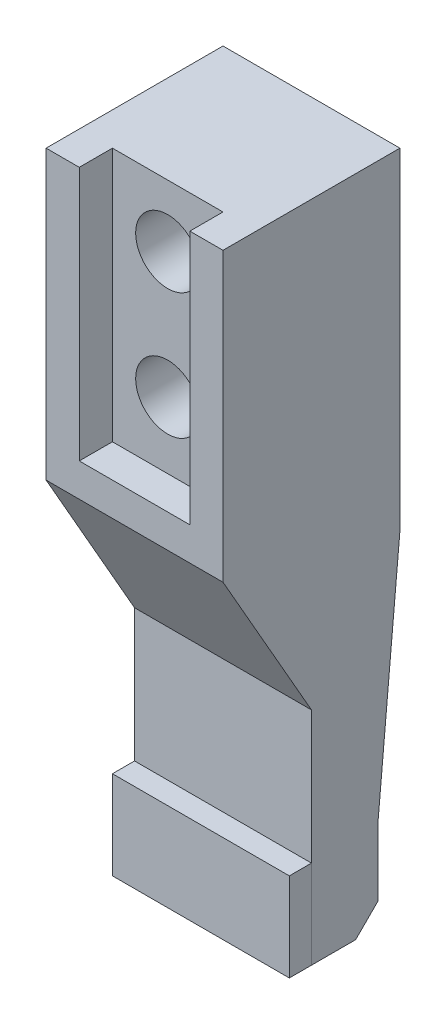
ISO-10303-21;
HEADER;
FILE_DESCRIPTION(('STEP AP214'),'2;1');
FILE_NAME('part.step','',(''),(''),'','','');
FILE_SCHEMA(('AUTOMOTIVE_DESIGN { 1 0 10303 214 1 1 1 1 }'));
ENDSEC;
DATA;
#1=APPLICATION_CONTEXT('core data for automotive mechanical design processes');
#2=APPLICATION_PROTOCOL_DEFINITION('international standard','automotive_design',2000,#1);
#3=PRODUCT_CONTEXT('',#1,'mechanical');
#4=PRODUCT('Part','Part','',(#3));
#5=PRODUCT_RELATED_PRODUCT_CATEGORY('part','',(#4));
#6=PRODUCT_DEFINITION_FORMATION('','',#4);
#7=PRODUCT_DEFINITION_CONTEXT('part definition',#1,'design');
#8=PRODUCT_DEFINITION('design','',#6,#7);
#9=PRODUCT_DEFINITION_SHAPE('','',#8);
#10=(LENGTH_UNIT() NAMED_UNIT(*) SI_UNIT(.MILLI.,.METRE.));
#11=(NAMED_UNIT(*) PLANE_ANGLE_UNIT() SI_UNIT($,.RADIAN.));
#12=(NAMED_UNIT(*) SI_UNIT($,.STERADIAN.) SOLID_ANGLE_UNIT());
#13=UNCERTAINTY_MEASURE_WITH_UNIT(LENGTH_MEASURE(1.E-05),#10,'distance_accuracy_value','');
#14=(GEOMETRIC_REPRESENTATION_CONTEXT(3) GLOBAL_UNCERTAINTY_ASSIGNED_CONTEXT((#13)) GLOBAL_UNIT_ASSIGNED_CONTEXT((#10,
#11,#12)) REPRESENTATION_CONTEXT('',''));
#15=CARTESIAN_POINT('',(0.,0.,0.));
#16=DIRECTION('',(0.,0.,1.));
#17=DIRECTION('',(1.,0.,0.));
#18=AXIS2_PLACEMENT_3D('',#15,#16,#17);
#19=CARTESIAN_POINT('',(-4.,-15.,5.));
#20=DIRECTION('',(1.,0.,0.));
#21=DIRECTION('',(0.,0.,-1.));
#22=AXIS2_PLACEMENT_3D('',#19,#20,#21);
#23=PLANE('',#22);
#24=DIRECTION('',(0.,-1.,0.));
#25=VECTOR('',#24,1.);
#26=CARTESIAN_POINT('',(-4.,-15.,4.));
#27=LINE('',#26,#25);
#28=CARTESIAN_POINT('',(-4.,-11.,4.));
#29=VERTEX_POINT('',#28);
#30=CARTESIAN_POINT('',(-4.,-15.,4.));
#31=VERTEX_POINT('',#30);
#32=EDGE_CURVE('E110',#29,#31,#27,.T.);
#33=ORIENTED_EDGE('',*,*,#32,.T.);
#34=DIRECTION('',(0.,0.,-1.));
#35=VECTOR('',#34,1.);
#36=CARTESIAN_POINT('',(-4.,-15.,5.));
#37=LINE('',#36,#35);
#38=CARTESIAN_POINT('',(-4.,-15.,5.));
#39=VERTEX_POINT('',#38);
#40=EDGE_CURVE('E12',#39,#31,#37,.T.);
#41=ORIENTED_EDGE('',*,*,#40,.F.);
#42=DIRECTION('',(0.,-1.,0.));
#43=VECTOR('',#42,1.);
#44=CARTESIAN_POINT('',(-4.,-15.,5.));
#45=LINE('',#44,#43);
#46=CARTESIAN_POINT('',(-4.,-11.,5.));
#47=VERTEX_POINT('',#46);
#48=EDGE_CURVE('E98',#47,#39,#45,.T.);
#49=ORIENTED_EDGE('',*,*,#48,.F.);
#50=DIRECTION('',(0.,0.,-1.));
#51=VECTOR('',#50,1.);
#52=CARTESIAN_POINT('',(-4.,-11.,5.));
#53=LINE('',#52,#51);
#54=EDGE_CURVE('E106',#47,#29,#53,.T.);
#55=ORIENTED_EDGE('',*,*,#54,.T.);
#56=EDGE_LOOP('',(#33,#41,#49,#55));
#57=FACE_BOUND('',#56,.T.);
#58=ADVANCED_FACE('F47',(#57),#23,.F.);
#59=CARTESIAN_POINT('',(-4.,-15.,5.));
#60=DIRECTION('',(0.,1.,0.));
#61=DIRECTION('',(0.,0.,1.));
#62=AXIS2_PLACEMENT_3D('',#59,#60,#61);
#63=PLANE('',#62);
#64=DIRECTION('',(1.,0.,0.));
#65=VECTOR('',#64,1.);
#66=CARTESIAN_POINT('',(-4.,-15.,4.));
#67=LINE('',#66,#65);
#68=CARTESIAN_POINT('',(4.,-15.,4.));
#69=VERTEX_POINT('',#68);
#70=EDGE_CURVE('E102',#31,#69,#67,.T.);
#71=ORIENTED_EDGE('',*,*,#70,.T.);
#72=DIRECTION('',(0.,0.,-1.));
#73=VECTOR('',#72,1.);
#74=CARTESIAN_POINT('',(4.,-15.,5.));
#75=LINE('',#74,#73);
#76=CARTESIAN_POINT('',(4.,-15.,5.));
#77=VERTEX_POINT('',#76);
#78=EDGE_CURVE('E55',#77,#69,#75,.T.);
#79=ORIENTED_EDGE('',*,*,#78,.F.);
#80=DIRECTION('',(1.,0.,0.));
#81=VECTOR('',#80,1.);
#82=CARTESIAN_POINT('',(-4.,-15.,5.));
#83=LINE('',#82,#81);
#84=EDGE_CURVE('E93',#39,#77,#83,.T.);
#85=ORIENTED_EDGE('',*,*,#84,.F.);
#86=ORIENTED_EDGE('',*,*,#40,.T.);
#87=EDGE_LOOP('',(#71,#79,#85,#86));
#88=FACE_BOUND('',#87,.T.);
#89=ADVANCED_FACE('F101',(#88),#63,.F.);
#90=CARTESIAN_POINT('',(4.,-15.,5.));
#91=DIRECTION('',(-1.,0.,0.));
#92=DIRECTION('',(0.,0.,1.));
#93=AXIS2_PLACEMENT_3D('',#90,#91,#92);
#94=PLANE('',#93);
#95=DIRECTION('',(0.,1.,0.));
#96=VECTOR('',#95,1.);
#97=CARTESIAN_POINT('',(4.,-15.,4.));
#98=LINE('',#97,#96);
#99=CARTESIAN_POINT('',(4.,-11.,4.));
#100=VERTEX_POINT('',#99);
#101=EDGE_CURVE('E80',#69,#100,#98,.T.);
#102=ORIENTED_EDGE('',*,*,#101,.T.);
#103=DIRECTION('',(0.,0.,-1.));
#104=VECTOR('',#103,1.);
#105=CARTESIAN_POINT('',(4.,-11.,5.));
#106=LINE('',#105,#104);
#107=CARTESIAN_POINT('',(4.,-11.,5.));
#108=VERTEX_POINT('',#107);
#109=EDGE_CURVE('E103',#108,#100,#106,.T.);
#110=ORIENTED_EDGE('',*,*,#109,.F.);
#111=DIRECTION('',(0.,1.,0.));
#112=VECTOR('',#111,1.);
#113=CARTESIAN_POINT('',(4.,-15.,5.));
#114=LINE('',#113,#112);
#115=EDGE_CURVE('E96',#77,#108,#114,.T.);
#116=ORIENTED_EDGE('',*,*,#115,.F.);
#117=ORIENTED_EDGE('',*,*,#78,.T.);
#118=EDGE_LOOP('',(#102,#110,#116,#117));
#119=FACE_BOUND('',#118,.T.);
#120=ADVANCED_FACE('F104',(#119),#94,.F.);
#121=CARTESIAN_POINT('',(-4.,-11.,5.));
#122=DIRECTION('',(0.,-1.,0.));
#123=DIRECTION('',(0.,0.,-1.));
#124=AXIS2_PLACEMENT_3D('',#121,#122,#123);
#125=PLANE('',#124);
#126=DIRECTION('',(-1.,0.,0.));
#127=VECTOR('',#126,1.);
#128=CARTESIAN_POINT('',(-4.,-11.,4.));
#129=LINE('',#128,#127);
#130=EDGE_CURVE('E86',#100,#29,#129,.T.);
#131=ORIENTED_EDGE('',*,*,#130,.T.);
#132=ORIENTED_EDGE('',*,*,#54,.F.);
#133=DIRECTION('',(-1.,0.,0.));
#134=VECTOR('',#133,1.);
#135=CARTESIAN_POINT('',(-4.,-11.,5.));
#136=LINE('',#135,#134);
#137=EDGE_CURVE('E63',#108,#47,#136,.T.);
#138=ORIENTED_EDGE('',*,*,#137,.F.);
#139=ORIENTED_EDGE('',*,*,#109,.T.);
#140=EDGE_LOOP('',(#131,#132,#138,#139));
#141=FACE_BOUND('',#140,.T.);
#142=ADVANCED_FACE('F117',(#141),#125,.F.);
#143=CARTESIAN_POINT('',(0.,0.,5.));
#144=DIRECTION('',(0.,0.,-1.));
#145=DIRECTION('',(-1.,0.,0.));
#146=AXIS2_PLACEMENT_3D('',#143,#144,#145);
#147=PLANE('',#146);
#148=ORIENTED_EDGE('',*,*,#48,.T.);
#149=ORIENTED_EDGE('',*,*,#84,.T.);
#150=ORIENTED_EDGE('',*,*,#115,.T.);
#151=ORIENTED_EDGE('',*,*,#137,.T.);
#152=EDGE_LOOP('',(#148,#149,#150,#151));
#153=FACE_BOUND('',#152,.T.);
#154=ADVANCED_FACE('F94',(#153),#147,.F.);
#155=CARTESIAN_POINT('',(0.,0.,4.));
#156=DIRECTION('',(0.,0.,-1.));
#157=DIRECTION('',(-1.,0.,0.));
#158=AXIS2_PLACEMENT_3D('',#155,#156,#157);
#159=PLANE('',#158);
#160=ORIENTED_EDGE('',*,*,#32,.F.);
#161=ORIENTED_EDGE('',*,*,#130,.F.);
#162=ORIENTED_EDGE('',*,*,#101,.F.);
#163=ORIENTED_EDGE('',*,*,#70,.F.);
#164=EDGE_LOOP('',(#160,#161,#162,#163));
#165=FACE_BOUND('',#164,.T.);
#166=ADVANCED_FACE('F120',(#165),#159,.T.);
#167=CLOSED_SHELL('',(#58,#89,#120,#142,#154,#166));
#168=MANIFOLD_SOLID_BREP('B2',#167);
#169=CARTESIAN_POINT('',(4.,-15.,8.));
#170=DIRECTION('',(-1.,0.,0.));
#171=DIRECTION('',(0.,0.,1.));
#172=AXIS2_PLACEMENT_3D('',#169,#170,#171);
#173=PLANE('',#172);
#174=DIRECTION('',(0.,0.,-1.));
#175=VECTOR('',#174,1.);
#176=CARTESIAN_POINT('',(4.,-15.,8.));
#177=LINE('',#176,#175);
#178=CARTESIAN_POINT('',(4.,-15.,4.));
#179=VERTEX_POINT('',#178);
#180=CARTESIAN_POINT('',(4.,-15.,2.));
#181=VERTEX_POINT('',#180);
#182=EDGE_CURVE('E354',#179,#181,#177,.T.);
#183=ORIENTED_EDGE('',*,*,#182,.T.);
#184=DIRECTION('',(0.,-0.707106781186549,0.707106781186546));
#185=VECTOR('',#184,1.);
#186=CARTESIAN_POINT('',(4.,-15.,2.));
#187=LINE('',#186,#185);
#188=CARTESIAN_POINT('',(4.,-14.,1.));
#189=VERTEX_POINT('',#188);
#190=EDGE_CURVE('E194',#181,#189,#187,.F.);
#191=ORIENTED_EDGE('',*,*,#190,.T.);
#192=DIRECTION('',(0.,-1.,0.));
#193=VECTOR('',#192,1.);
#194=CARTESIAN_POINT('',(4.,-15.,1.));
#195=LINE('',#194,#193);
#196=CARTESIAN_POINT('',(4.,-11.,1.));
#197=VERTEX_POINT('',#196);
#198=EDGE_CURVE('E286',#197,#189,#195,.T.);
#199=ORIENTED_EDGE('',*,*,#198,.F.);
#200=DIRECTION('',(0.,-0.995893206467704,0.0905357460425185));
#201=VECTOR('',#200,1.);
#202=CARTESIAN_POINT('',(4.,-11.,1.));
#203=LINE('',#202,#201);
#204=CARTESIAN_POINT('',(4.,0.,0.));
#205=VERTEX_POINT('',#204);
#206=EDGE_CURVE('E272',#205,#197,#203,.T.);
#207=ORIENTED_EDGE('',*,*,#206,.F.);
#208=DIRECTION('',(0.,1.,0.));
#209=VECTOR('',#208,1.);
#210=CARTESIAN_POINT('',(4.,-15.,0.));
#211=LINE('',#210,#209);
#212=CARTESIAN_POINT('',(4.,15.,0.));
#213=VERTEX_POINT('',#212);
#214=EDGE_CURVE('E337',#205,#213,#211,.T.);
#215=ORIENTED_EDGE('',*,*,#214,.T.);
#216=DIRECTION('',(0.,0.,-1.));
#217=VECTOR('',#216,1.);
#218=CARTESIAN_POINT('',(4.,15.,8.));
#219=LINE('',#218,#217);
#220=CARTESIAN_POINT('',(4.,15.,8.));
#221=VERTEX_POINT('',#220);
#222=EDGE_CURVE('E365',#221,#213,#219,.T.);
#223=ORIENTED_EDGE('',*,*,#222,.F.);
#224=DIRECTION('',(0.,1.,0.));
#225=VECTOR('',#224,1.);
#226=CARTESIAN_POINT('',(4.,-15.,8.));
#227=LINE('',#226,#225);
#228=CARTESIAN_POINT('',(4.,2.,8.));
#229=VERTEX_POINT('',#228);
#230=EDGE_CURVE('E345',#229,#221,#227,.T.);
#231=ORIENTED_EDGE('',*,*,#230,.F.);
#232=DIRECTION('',(0.,0.868243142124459,0.496138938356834));
#233=VECTOR('',#232,1.);
#234=CARTESIAN_POINT('',(4.,-10.8153846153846,0.676923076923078));
#235=LINE('',#234,#233);
#236=CARTESIAN_POINT('',(4.,-5.,4.));
#237=VERTEX_POINT('',#236);
#238=EDGE_CURVE('E307',#237,#229,#235,.T.);
#239=ORIENTED_EDGE('',*,*,#238,.F.);
#240=DIRECTION('',(0.,1.,0.));
#241=VECTOR('',#240,1.);
#242=CARTESIAN_POINT('',(4.,-15.,4.));
#243=LINE('',#242,#241);
#244=EDGE_CURVE('E313',#179,#237,#243,.T.);
#245=ORIENTED_EDGE('',*,*,#244,.F.);
#246=EDGE_LOOP('',(#183,#191,#199,#207,#215,#223,#231,#239,#245));
#247=FACE_BOUND('',#246,.T.);
#248=ADVANCED_FACE('F171',(#247),#173,.F.);
#249=CARTESIAN_POINT('',(-4.,-15.,8.));
#250=DIRECTION('',(1.,0.,0.));
#251=DIRECTION('',(0.,0.,-1.));
#252=AXIS2_PLACEMENT_3D('',#249,#250,#251);
#253=PLANE('',#252);
#254=DIRECTION('',(0.,-1.,0.));
#255=VECTOR('',#254,1.);
#256=CARTESIAN_POINT('',(-4.,-15.,1.));
#257=LINE('',#256,#255);
#258=CARTESIAN_POINT('',(-4.,-11.,1.));
#259=VERTEX_POINT('',#258);
#260=CARTESIAN_POINT('',(-4.,-14.,1.));
#261=VERTEX_POINT('',#260);
#262=EDGE_CURVE('E276',#259,#261,#257,.T.);
#263=ORIENTED_EDGE('',*,*,#262,.T.);
#264=DIRECTION('',(0.,0.707106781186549,-0.707106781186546));
#265=VECTOR('',#264,1.);
#266=CARTESIAN_POINT('',(-4.,-15.,2.));
#267=LINE('',#266,#265);
#268=CARTESIAN_POINT('',(-4.,-15.,2.));
#269=VERTEX_POINT('',#268);
#270=EDGE_CURVE('E45',#261,#269,#267,.F.);
#271=ORIENTED_EDGE('',*,*,#270,.T.);
#272=DIRECTION('',(0.,0.,-1.));
#273=VECTOR('',#272,1.);
#274=CARTESIAN_POINT('',(-4.,-15.,8.));
#275=LINE('',#274,#273);
#276=CARTESIAN_POINT('',(-4.,-15.,4.));
#277=VERTEX_POINT('',#276);
#278=EDGE_CURVE('E360',#277,#269,#275,.T.);
#279=ORIENTED_EDGE('',*,*,#278,.F.);
#280=DIRECTION('',(0.,-1.,0.));
#281=VECTOR('',#280,1.);
#282=CARTESIAN_POINT('',(-4.,0.,4.));
#283=LINE('',#282,#281);
#284=CARTESIAN_POINT('',(-4.,-5.,4.));
#285=VERTEX_POINT('',#284);
#286=EDGE_CURVE('E299',#285,#277,#283,.T.);
#287=ORIENTED_EDGE('',*,*,#286,.F.);
#288=DIRECTION('',(0.,-0.868243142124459,-0.496138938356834));
#289=VECTOR('',#288,1.);
#290=CARTESIAN_POINT('',(-4.,-2.95384615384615,5.16923076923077));
#291=LINE('',#290,#289);
#292=CARTESIAN_POINT('',(-4.,2.00000000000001,8.));
#293=VERTEX_POINT('',#292);
#294=EDGE_CURVE('E301',#293,#285,#291,.T.);
#295=ORIENTED_EDGE('',*,*,#294,.F.);
#296=DIRECTION('',(0.,-1.,0.));
#297=VECTOR('',#296,1.);
#298=CARTESIAN_POINT('',(-4.,-15.,8.));
#299=LINE('',#298,#297);
#300=CARTESIAN_POINT('',(-4.,15.,8.));
#301=VERTEX_POINT('',#300);
#302=EDGE_CURVE('E351',#301,#293,#299,.T.);
#303=ORIENTED_EDGE('',*,*,#302,.F.);
#304=DIRECTION('',(0.,0.,-1.));
#305=VECTOR('',#304,1.);
#306=CARTESIAN_POINT('',(-4.,15.,8.));
#307=LINE('',#306,#305);
#308=CARTESIAN_POINT('',(-4.,15.,0.));
#309=VERTEX_POINT('',#308);
#310=EDGE_CURVE('E363',#301,#309,#307,.T.);
#311=ORIENTED_EDGE('',*,*,#310,.T.);
#312=DIRECTION('',(0.,-1.,0.));
#313=VECTOR('',#312,1.);
#314=CARTESIAN_POINT('',(-4.,-15.,0.));
#315=LINE('',#314,#313);
#316=CARTESIAN_POINT('',(-4.,0.,0.));
#317=VERTEX_POINT('',#316);
#318=EDGE_CURVE('E285',#309,#317,#315,.T.);
#319=ORIENTED_EDGE('',*,*,#318,.T.);
#320=DIRECTION('',(0.,-0.995893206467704,0.0905357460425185));
#321=VECTOR('',#320,1.);
#322=CARTESIAN_POINT('',(-4.,-11.,1.));
#323=LINE('',#322,#321);
#324=EDGE_CURVE('E269',#317,#259,#323,.T.);
#325=ORIENTED_EDGE('',*,*,#324,.T.);
#326=EDGE_LOOP('',(#263,#271,#279,#287,#295,#303,#311,#319,#325));
#327=FACE_BOUND('',#326,.T.);
#328=ADVANCED_FACE('F282',(#327),#253,.F.);
#329=CARTESIAN_POINT('',(-4.,-15.,8.));
#330=DIRECTION('',(0.,1.,0.));
#331=DIRECTION('',(0.,0.,1.));
#332=AXIS2_PLACEMENT_3D('',#329,#330,#331);
#333=PLANE('',#332);
#334=ORIENTED_EDGE('',*,*,#278,.T.);
#335=DIRECTION('',(1.,0.,0.));
#336=VECTOR('',#335,1.);
#337=CARTESIAN_POINT('',(-4.,-15.,2.));
#338=LINE('',#337,#336);
#339=EDGE_CURVE('E368',#269,#181,#338,.T.);
#340=ORIENTED_EDGE('',*,*,#339,.T.);
#341=ORIENTED_EDGE('',*,*,#182,.F.);
#342=DIRECTION('',(1.,0.,0.));
#343=VECTOR('',#342,1.);
#344=CARTESIAN_POINT('',(-4.,-15.,4.));
#345=LINE('',#344,#343);
#346=EDGE_CURVE('E303',#277,#179,#345,.T.);
#347=ORIENTED_EDGE('',*,*,#346,.F.);
#348=EDGE_LOOP('',(#334,#340,#341,#347));
#349=FACE_BOUND('',#348,.T.);
#350=ADVANCED_FACE('F378',(#349),#333,.F.);
#351=CARTESIAN_POINT('',(0.,0.,8.));
#352=DIRECTION('',(0.,0.,-1.));
#353=DIRECTION('',(-1.,0.,0.));
#354=AXIS2_PLACEMENT_3D('',#351,#352,#353);
#355=PLANE('',#354);
#356=DIRECTION('',(1.,0.,0.));
#357=VECTOR('',#356,1.);
#358=CARTESIAN_POINT('',(-4.,2.00000000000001,8.));
#359=LINE('',#358,#357);
#360=EDGE_CURVE('E304',#293,#229,#359,.T.);
#361=ORIENTED_EDGE('',*,*,#360,.T.);
#362=ORIENTED_EDGE('',*,*,#230,.T.);
#363=DIRECTION('',(-1.,0.,0.));
#364=VECTOR('',#363,1.);
#365=CARTESIAN_POINT('',(-4.,15.,8.));
#366=LINE('',#365,#364);
#367=CARTESIAN_POINT('',(2.5,15.,8.));
#368=VERTEX_POINT('',#367);
#369=EDGE_CURVE('E348',#221,#368,#366,.T.);
#370=ORIENTED_EDGE('',*,*,#369,.T.);
#371=DIRECTION('',(0.,1.,0.));
#372=VECTOR('',#371,1.);
#373=CARTESIAN_POINT('',(2.5,15.,8.));
#374=LINE('',#373,#372);
#375=CARTESIAN_POINT('',(2.5,3.5,8.));
#376=VERTEX_POINT('',#375);
#377=EDGE_CURVE('E320',#376,#368,#374,.T.);
#378=ORIENTED_EDGE('',*,*,#377,.F.);
#379=DIRECTION('',(1.,0.,0.));
#380=VECTOR('',#379,1.);
#381=CARTESIAN_POINT('',(-2.5,3.5,8.));
#382=LINE('',#381,#380);
#383=CARTESIAN_POINT('',(-2.5,3.5,8.));
#384=VERTEX_POINT('',#383);
#385=EDGE_CURVE('E331',#384,#376,#382,.T.);
#386=ORIENTED_EDGE('',*,*,#385,.F.);
#387=DIRECTION('',(0.,-1.,0.));
#388=VECTOR('',#387,1.);
#389=CARTESIAN_POINT('',(-2.5,15.,8.));
#390=LINE('',#389,#388);
#391=CARTESIAN_POINT('',(-2.5,15.,8.));
#392=VERTEX_POINT('',#391);
#393=EDGE_CURVE('E315',#392,#384,#390,.T.);
#394=ORIENTED_EDGE('',*,*,#393,.F.);
#395=EDGE_CURVE('E347',#392,#301,#366,.T.);
#396=ORIENTED_EDGE('',*,*,#395,.T.);
#397=ORIENTED_EDGE('',*,*,#302,.T.);
#398=EDGE_LOOP('',(#361,#362,#370,#378,#386,#394,#396,#397));
#399=FACE_BOUND('',#398,.T.);
#400=ADVANCED_FACE('F394',(#399),#355,.F.);
#401=CARTESIAN_POINT('',(-4.,15.,8.));
#402=DIRECTION('',(0.,-1.,0.));
#403=DIRECTION('',(0.,0.,-1.));
#404=AXIS2_PLACEMENT_3D('',#401,#402,#403);
#405=PLANE('',#404);
#406=ORIENTED_EDGE('',*,*,#395,.F.);
#407=DIRECTION('',(0.,0.,1.));
#408=VECTOR('',#407,1.);
#409=CARTESIAN_POINT('',(-2.5,15.,6.5));
#410=LINE('',#409,#408);
#411=CARTESIAN_POINT('',(-2.5,15.,6.5));
#412=VERTEX_POINT('',#411);
#413=EDGE_CURVE('E335',#412,#392,#410,.T.);
#414=ORIENTED_EDGE('',*,*,#413,.F.);
#415=DIRECTION('',(-1.,0.,0.));
#416=VECTOR('',#415,1.);
#417=CARTESIAN_POINT('',(-2.5,15.,6.5));
#418=LINE('',#417,#416);
#419=CARTESIAN_POINT('',(2.5,15.,6.5));
#420=VERTEX_POINT('',#419);
#421=EDGE_CURVE('E326',#420,#412,#418,.T.);
#422=ORIENTED_EDGE('',*,*,#421,.F.);
#423=DIRECTION('',(0.,0.,1.));
#424=VECTOR('',#423,1.);
#425=CARTESIAN_POINT('',(2.5,15.,6.5));
#426=LINE('',#425,#424);
#427=EDGE_CURVE('E338',#420,#368,#426,.T.);
#428=ORIENTED_EDGE('',*,*,#427,.T.);
#429=ORIENTED_EDGE('',*,*,#369,.F.);
#430=ORIENTED_EDGE('',*,*,#222,.T.);
#431=DIRECTION('',(-1.,0.,0.));
#432=VECTOR('',#431,1.);
#433=CARTESIAN_POINT('',(-4.,15.,0.));
#434=LINE('',#433,#432);
#435=EDGE_CURVE('E356',#213,#309,#434,.T.);
#436=ORIENTED_EDGE('',*,*,#435,.T.);
#437=ORIENTED_EDGE('',*,*,#310,.F.);
#438=EDGE_LOOP('',(#406,#414,#422,#428,#429,#430,#436,#437));
#439=FACE_BOUND('',#438,.T.);
#440=ADVANCED_FACE('F401',(#439),#405,.F.);
#441=CARTESIAN_POINT('',(0.,0.,0.));
#442=DIRECTION('',(0.,0.,-1.));
#443=DIRECTION('',(-1.,0.,0.));
#444=AXIS2_PLACEMENT_3D('',#441,#442,#443);
#445=PLANE('',#444);
#446=DIRECTION('',(1.,0.,0.));
#447=VECTOR('',#446,1.);
#448=CARTESIAN_POINT('',(-4.,0.,0.));
#449=LINE('',#448,#447);
#450=EDGE_CURVE('E274',#317,#205,#449,.T.);
#451=ORIENTED_EDGE('',*,*,#450,.F.);
#452=ORIENTED_EDGE('',*,*,#318,.F.);
#453=ORIENTED_EDGE('',*,*,#435,.F.);
#454=ORIENTED_EDGE('',*,*,#214,.F.);
#455=EDGE_LOOP('',(#451,#452,#453,#454));
#456=FACE_BOUND('',#455,.T.);
#457=CARTESIAN_POINT('',(0.,6.50000000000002,0.));
#458=DIRECTION('',(0.,0.,-1.));
#459=DIRECTION('',(-1.,0.,0.));
#460=AXIS2_PLACEMENT_3D('',#457,#458,#459);
#461=CIRCLE('',#460,1.45);
#462=CARTESIAN_POINT('',(-1.44999999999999,6.50000000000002,0.));
#463=VERTEX_POINT('',#462);
#464=EDGE_CURVE('E273',#463,#463,#461,.T.);
#465=ORIENTED_EDGE('',*,*,#464,.F.);
#466=EDGE_LOOP('',(#465));
#467=FACE_BOUND('',#466,.T.);
#468=CARTESIAN_POINT('',(0.,12.2,0.));
#469=DIRECTION('',(0.,0.,-1.));
#470=DIRECTION('',(-1.,0.,0.));
#471=AXIS2_PLACEMENT_3D('',#468,#469,#470);
#472=CIRCLE('',#471,1.45);
#473=CARTESIAN_POINT('',(-1.45,12.2,0.));
#474=VERTEX_POINT('',#473);
#475=EDGE_CURVE('E295',#474,#474,#472,.T.);
#476=ORIENTED_EDGE('',*,*,#475,.F.);
#477=EDGE_LOOP('',(#476));
#478=FACE_BOUND('',#477,.T.);
#479=ADVANCED_FACE('F404',(#456,#467,#478),#445,.T.);
#480=CARTESIAN_POINT('',(-2.5,15.,6.5));
#481=DIRECTION('',(-1.,0.,0.));
#482=DIRECTION('',(0.,-1.,0.));
#483=AXIS2_PLACEMENT_3D('',#480,#481,#482);
#484=PLANE('',#483);
#485=ORIENTED_EDGE('',*,*,#393,.T.);
#486=DIRECTION('',(0.,0.,1.));
#487=VECTOR('',#486,1.);
#488=CARTESIAN_POINT('',(-2.5,3.5,6.5));
#489=LINE('',#488,#487);
#490=CARTESIAN_POINT('',(-2.5,3.5,6.5));
#491=VERTEX_POINT('',#490);
#492=EDGE_CURVE('E329',#491,#384,#489,.T.);
#493=ORIENTED_EDGE('',*,*,#492,.F.);
#494=DIRECTION('',(0.,-1.,0.));
#495=VECTOR('',#494,1.);
#496=CARTESIAN_POINT('',(-2.5,15.,6.5));
#497=LINE('',#496,#495);
#498=EDGE_CURVE('E316',#412,#491,#497,.T.);
#499=ORIENTED_EDGE('',*,*,#498,.F.);
#500=ORIENTED_EDGE('',*,*,#413,.T.);
#501=EDGE_LOOP('',(#485,#493,#499,#500));
#502=FACE_BOUND('',#501,.T.);
#503=ADVANCED_FACE('F425',(#502),#484,.F.);
#504=CARTESIAN_POINT('',(2.5,15.,6.5));
#505=DIRECTION('',(1.,0.,0.));
#506=DIRECTION('',(0.,1.,0.));
#507=AXIS2_PLACEMENT_3D('',#504,#505,#506);
#508=PLANE('',#507);
#509=ORIENTED_EDGE('',*,*,#377,.T.);
#510=ORIENTED_EDGE('',*,*,#427,.F.);
#511=DIRECTION('',(0.,1.,0.));
#512=VECTOR('',#511,1.);
#513=CARTESIAN_POINT('',(2.5,15.,6.5));
#514=LINE('',#513,#512);
#515=CARTESIAN_POINT('',(2.5,3.5,6.5));
#516=VERTEX_POINT('',#515);
#517=EDGE_CURVE('E323',#516,#420,#514,.T.);
#518=ORIENTED_EDGE('',*,*,#517,.F.);
#519=DIRECTION('',(0.,0.,1.));
#520=VECTOR('',#519,1.);
#521=CARTESIAN_POINT('',(2.5,3.5,6.5));
#522=LINE('',#521,#520);
#523=EDGE_CURVE('E341',#516,#376,#522,.T.);
#524=ORIENTED_EDGE('',*,*,#523,.T.);
#525=EDGE_LOOP('',(#509,#510,#518,#524));
#526=FACE_BOUND('',#525,.T.);
#527=ADVANCED_FACE('F430',(#526),#508,.F.);
#528=CARTESIAN_POINT('',(-2.5,3.5,6.5));
#529=DIRECTION('',(0.,-1.,0.));
#530=DIRECTION('',(0.,0.,-1.));
#531=AXIS2_PLACEMENT_3D('',#528,#529,#530);
#532=PLANE('',#531);
#533=ORIENTED_EDGE('',*,*,#385,.T.);
#534=ORIENTED_EDGE('',*,*,#523,.F.);
#535=DIRECTION('',(1.,0.,0.));
#536=VECTOR('',#535,1.);
#537=CARTESIAN_POINT('',(-2.5,3.5,6.5));
#538=LINE('',#537,#536);
#539=EDGE_CURVE('E319',#491,#516,#538,.T.);
#540=ORIENTED_EDGE('',*,*,#539,.F.);
#541=ORIENTED_EDGE('',*,*,#492,.T.);
#542=EDGE_LOOP('',(#533,#534,#540,#541));
#543=FACE_BOUND('',#542,.T.);
#544=ADVANCED_FACE('F432',(#543),#532,.F.);
#545=CARTESIAN_POINT('',(0.,0.,6.5));
#546=DIRECTION('',(0.,0.,1.));
#547=DIRECTION('',(1.,0.,0.));
#548=AXIS2_PLACEMENT_3D('',#545,#546,#547);
#549=PLANE('',#548);
#550=CARTESIAN_POINT('',(0.,6.50000000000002,6.5));
#551=DIRECTION('',(0.,0.,1.));
#552=DIRECTION('',(1.,0.,0.));
#553=AXIS2_PLACEMENT_3D('',#550,#551,#552);
#554=CIRCLE('',#553,1.45);
#555=CARTESIAN_POINT('',(1.45000000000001,6.50000000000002,6.5));
#556=VERTEX_POINT('',#555);
#557=EDGE_CURVE('E294',#556,#556,#554,.T.);
#558=ORIENTED_EDGE('',*,*,#557,.F.);
#559=EDGE_LOOP('',(#558));
#560=FACE_BOUND('',#559,.T.);
#561=CARTESIAN_POINT('',(0.,12.2,6.5));
#562=DIRECTION('',(0.,0.,1.));
#563=DIRECTION('',(1.,0.,0.));
#564=AXIS2_PLACEMENT_3D('',#561,#562,#563);
#565=CIRCLE('',#564,1.45);
#566=CARTESIAN_POINT('',(1.45,12.2,6.5));
#567=VERTEX_POINT('',#566);
#568=EDGE_CURVE('E298',#567,#567,#565,.T.);
#569=ORIENTED_EDGE('',*,*,#568,.F.);
#570=EDGE_LOOP('',(#569));
#571=FACE_BOUND('',#570,.T.);
#572=ORIENTED_EDGE('',*,*,#498,.T.);
#573=ORIENTED_EDGE('',*,*,#539,.T.);
#574=ORIENTED_EDGE('',*,*,#517,.T.);
#575=ORIENTED_EDGE('',*,*,#421,.T.);
#576=EDGE_LOOP('',(#572,#573,#574,#575));
#577=FACE_BOUND('',#576,.T.);
#578=ADVANCED_FACE('F435',(#560,#571,#577),#549,.T.);
#579=CARTESIAN_POINT('',(-4.,0.,4.));
#580=DIRECTION('',(0.,0.,1.));
#581=DIRECTION('',(0.,-1.,0.));
#582=AXIS2_PLACEMENT_3D('',#579,#580,#581);
#583=PLANE('',#582);
#584=ORIENTED_EDGE('',*,*,#244,.T.);
#585=DIRECTION('',(1.,0.,0.));
#586=VECTOR('',#585,1.);
#587=CARTESIAN_POINT('',(-4.,-5.,4.));
#588=LINE('',#587,#586);
#589=EDGE_CURVE('E308',#285,#237,#588,.T.);
#590=ORIENTED_EDGE('',*,*,#589,.F.);
#591=ORIENTED_EDGE('',*,*,#286,.T.);
#592=ORIENTED_EDGE('',*,*,#346,.T.);
#593=EDGE_LOOP('',(#584,#590,#591,#592));
#594=FACE_BOUND('',#593,.T.);
#595=ADVANCED_FACE('F387',(#594),#583,.T.);
#596=CARTESIAN_POINT('',(-4.,-2.95384615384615,5.16923076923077));
#597=DIRECTION('',(0.,-0.496138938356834,0.868243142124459));
#598=DIRECTION('',(0.,-0.868243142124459,-0.496138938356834));
#599=AXIS2_PLACEMENT_3D('',#596,#597,#598);
#600=PLANE('',#599);
#601=ORIENTED_EDGE('',*,*,#238,.T.);
#602=ORIENTED_EDGE('',*,*,#360,.F.);
#603=ORIENTED_EDGE('',*,*,#294,.T.);
#604=ORIENTED_EDGE('',*,*,#589,.T.);
#605=EDGE_LOOP('',(#601,#602,#603,#604));
#606=FACE_BOUND('',#605,.T.);
#607=ADVANCED_FACE('F390',(#606),#600,.T.);
#608=CARTESIAN_POINT('',(0.,12.2,0.));
#609=DIRECTION('',(0.,0.,-1.));
#610=DIRECTION('',(-1.,0.,0.));
#611=AXIS2_PLACEMENT_3D('',#608,#609,#610);
#612=CYLINDRICAL_SURFACE('',#611,1.45);
#613=ORIENTED_EDGE('',*,*,#568,.T.);
#614=EDGE_LOOP('',(#613));
#615=FACE_BOUND('',#614,.T.);
#616=ORIENTED_EDGE('',*,*,#475,.T.);
#617=EDGE_LOOP('',(#616));
#618=FACE_BOUND('',#617,.T.);
#619=ADVANCED_FACE('F447',(#615,#618),#612,.F.);
#620=CARTESIAN_POINT('',(0.,6.50000000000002,0.));
#621=DIRECTION('',(0.,0.,-1.));
#622=DIRECTION('',(-1.,0.,0.));
#623=AXIS2_PLACEMENT_3D('',#620,#621,#622);
#624=CYLINDRICAL_SURFACE('',#623,1.45);
#625=ORIENTED_EDGE('',*,*,#557,.T.);
#626=EDGE_LOOP('',(#625));
#627=FACE_BOUND('',#626,.T.);
#628=ORIENTED_EDGE('',*,*,#464,.T.);
#629=EDGE_LOOP('',(#628));
#630=FACE_BOUND('',#629,.T.);
#631=ADVANCED_FACE('F450',(#627,#630),#624,.F.);
#632=CARTESIAN_POINT('',(-4.,-15.,1.));
#633=DIRECTION('',(0.,0.,1.));
#634=DIRECTION('',(1.,0.,0.));
#635=AXIS2_PLACEMENT_3D('',#632,#633,#634);
#636=PLANE('',#635);
#637=ORIENTED_EDGE('',*,*,#198,.T.);
#638=DIRECTION('',(-1.,0.,0.));
#639=VECTOR('',#638,1.);
#640=CARTESIAN_POINT('',(-4.,-14.,1.));
#641=LINE('',#640,#639);
#642=EDGE_CURVE('E180',#189,#261,#641,.T.);
#643=ORIENTED_EDGE('',*,*,#642,.T.);
#644=ORIENTED_EDGE('',*,*,#262,.F.);
#645=DIRECTION('',(1.,0.,0.));
#646=VECTOR('',#645,1.);
#647=CARTESIAN_POINT('',(-4.,-11.,1.));
#648=LINE('',#647,#646);
#649=EDGE_CURVE('E266',#259,#197,#648,.T.);
#650=ORIENTED_EDGE('',*,*,#649,.T.);
#651=EDGE_LOOP('',(#637,#643,#644,#650));
#652=FACE_BOUND('',#651,.T.);
#653=ADVANCED_FACE('F277',(#652),#636,.F.);
#654=CARTESIAN_POINT('',(-4.,-11.,1.));
#655=DIRECTION('',(0.,0.0905357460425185,0.995893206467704));
#656=DIRECTION('',(0.,-0.995893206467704,0.0905357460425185));
#657=AXIS2_PLACEMENT_3D('',#654,#655,#656);
#658=PLANE('',#657);
#659=ORIENTED_EDGE('',*,*,#206,.T.);
#660=ORIENTED_EDGE('',*,*,#649,.F.);
#661=ORIENTED_EDGE('',*,*,#324,.F.);
#662=ORIENTED_EDGE('',*,*,#450,.T.);
#663=EDGE_LOOP('',(#659,#660,#661,#662));
#664=FACE_BOUND('',#663,.T.);
#665=ADVANCED_FACE('F267',(#664),#658,.F.);
#666=CARTESIAN_POINT('',(-4.,-15.,2.));
#667=DIRECTION('',(0.,0.707106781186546,0.707106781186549));
#668=DIRECTION('',(1.,0.,0.));
#669=AXIS2_PLACEMENT_3D('',#666,#667,#668);
#670=PLANE('',#669);
#671=ORIENTED_EDGE('',*,*,#270,.F.);
#672=ORIENTED_EDGE('',*,*,#642,.F.);
#673=ORIENTED_EDGE('',*,*,#190,.F.);
#674=ORIENTED_EDGE('',*,*,#339,.F.);
#675=EDGE_LOOP('',(#671,#672,#673,#674));
#676=FACE_BOUND('',#675,.T.);
#677=ADVANCED_FACE('F174',(#676),#670,.F.);
#678=CLOSED_SHELL('',(#248,#328,#350,#400,#440,#479,#503,#527,#544,#578,#595,#607,#619,#631,
#653,#665,#677));
#679=MANIFOLD_SOLID_BREP('B6',#678);
#680=ADVANCED_BREP_SHAPE_REPRESENTATION('',(#18,#168,#679),#14);
#681=SHAPE_DEFINITION_REPRESENTATION(#9,#680);
ENDSEC;
END-ISO-10303-21;
